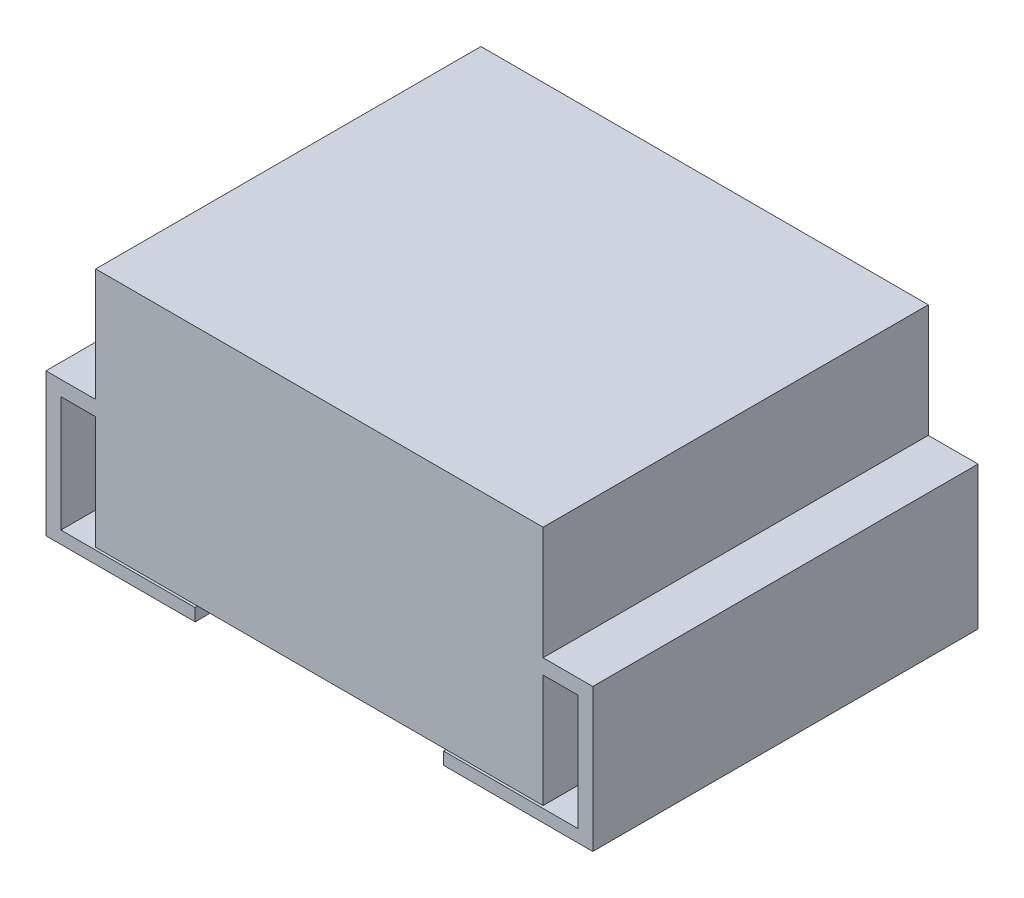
ISO-10303-21;
HEADER;
FILE_DESCRIPTION(('STEP AP214'),'2;1');
FILE_NAME('part.step','',(''),(''),'','','');
FILE_SCHEMA(('AUTOMOTIVE_DESIGN { 1 0 10303 214 1 1 1 1 }'));
ENDSEC;
DATA;
#1=APPLICATION_CONTEXT('core data for automotive mechanical design processes');
#2=APPLICATION_PROTOCOL_DEFINITION('international standard','automotive_design',2000,#1);
#3=PRODUCT_CONTEXT('',#1,'mechanical');
#4=PRODUCT('Part','Part','',(#3));
#5=PRODUCT_RELATED_PRODUCT_CATEGORY('part','',(#4));
#6=PRODUCT_DEFINITION_FORMATION('','',#4);
#7=PRODUCT_DEFINITION_CONTEXT('part definition',#1,'design');
#8=PRODUCT_DEFINITION('design','',#6,#7);
#9=PRODUCT_DEFINITION_SHAPE('','',#8);
#10=(LENGTH_UNIT() NAMED_UNIT(*) SI_UNIT(.MILLI.,.METRE.));
#11=(NAMED_UNIT(*) PLANE_ANGLE_UNIT() SI_UNIT($,.RADIAN.));
#12=(NAMED_UNIT(*) SI_UNIT($,.STERADIAN.) SOLID_ANGLE_UNIT());
#13=UNCERTAINTY_MEASURE_WITH_UNIT(LENGTH_MEASURE(1.E-05),#10,'distance_accuracy_value','');
#14=(GEOMETRIC_REPRESENTATION_CONTEXT(3) GLOBAL_UNCERTAINTY_ASSIGNED_CONTEXT((#13)) GLOBAL_UNIT_ASSIGNED_CONTEXT((#10,
#11,#12)) REPRESENTATION_CONTEXT('',''));
#15=CARTESIAN_POINT('',(0.,0.,0.));
#16=DIRECTION('',(0.,0.,1.));
#17=DIRECTION('',(1.,0.,0.));
#18=AXIS2_PLACEMENT_3D('',#15,#16,#17);
#19=CARTESIAN_POINT('',(2.286,2.4638,-1.96849999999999));
#20=DIRECTION('',(-1.,0.,0.));
#21=DIRECTION('',(0.,0.,1.));
#22=AXIS2_PLACEMENT_3D('',#19,#20,#21);
#23=PLANE('',#22);
#24=DIRECTION('',(0.,0.,-1.));
#25=VECTOR('',#24,1.);
#26=CARTESIAN_POINT('',(2.286,1.1557,1.96850000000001));
#27=LINE('',#26,#25);
#28=CARTESIAN_POINT('',(2.286,1.1557,1.96850000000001));
#29=VERTEX_POINT('',#28);
#30=CARTESIAN_POINT('',(2.286,1.1557,-1.96849999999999));
#31=VERTEX_POINT('',#30);
#32=EDGE_CURVE('E48',#29,#31,#27,.T.);
#33=ORIENTED_EDGE('',*,*,#32,.F.);
#34=DIRECTION('',(0.,-1.,0.));
#35=VECTOR('',#34,1.);
#36=CARTESIAN_POINT('',(2.286,2.4638,1.96850000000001));
#37=LINE('',#36,#35);
#38=CARTESIAN_POINT('',(2.286,0.,1.96850000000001));
#39=VERTEX_POINT('',#38);
#40=EDGE_CURVE('E295',#29,#39,#37,.T.);
#41=ORIENTED_EDGE('',*,*,#40,.T.);
#42=DIRECTION('',(0.,0.,-1.));
#43=VECTOR('',#42,1.);
#44=CARTESIAN_POINT('',(2.286,0.,-1.96849999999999));
#45=LINE('',#44,#43);
#46=CARTESIAN_POINT('',(2.286,0.,-1.96849999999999));
#47=VERTEX_POINT('',#46);
#48=EDGE_CURVE('E284',#39,#47,#45,.T.);
#49=ORIENTED_EDGE('',*,*,#48,.T.);
#50=DIRECTION('',(0.,-1.,0.));
#51=VECTOR('',#50,1.);
#52=CARTESIAN_POINT('',(2.286,2.4638,-1.96849999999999));
#53=LINE('',#52,#51);
#54=EDGE_CURVE('E41',#31,#47,#53,.T.);
#55=ORIENTED_EDGE('',*,*,#54,.F.);
#56=EDGE_LOOP('',(#33,#41,#49,#55));
#57=FACE_BOUND('',#56,.T.);
#58=ADVANCED_FACE('F34',(#57),#23,.F.);
#59=DIRECTION('',(0.,0.,1.));
#60=VECTOR('',#59,1.);
#61=CARTESIAN_POINT('',(2.286,1.3081,1.96850000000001));
#62=LINE('',#61,#60);
#63=CARTESIAN_POINT('',(2.286,1.3081,-1.96849999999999));
#64=VERTEX_POINT('',#63);
#65=CARTESIAN_POINT('',(2.286,1.3081,1.96850000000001));
#66=VERTEX_POINT('',#65);
#67=EDGE_CURVE('E209',#64,#66,#62,.T.);
#68=ORIENTED_EDGE('',*,*,#67,.F.);
#69=CARTESIAN_POINT('',(2.286,2.4638,-1.96849999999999));
#70=VERTEX_POINT('',#69);
#71=EDGE_CURVE('E11',#70,#64,#53,.T.);
#72=ORIENTED_EDGE('',*,*,#71,.F.);
#73=DIRECTION('',(0.,0.,-1.));
#74=VECTOR('',#73,1.);
#75=CARTESIAN_POINT('',(2.286,2.4638,-1.96849999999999));
#76=LINE('',#75,#74);
#77=CARTESIAN_POINT('',(2.286,2.4638,1.96850000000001));
#78=VERTEX_POINT('',#77);
#79=EDGE_CURVE('E285',#78,#70,#76,.T.);
#80=ORIENTED_EDGE('',*,*,#79,.F.);
#81=EDGE_CURVE('E304',#78,#66,#37,.T.);
#82=ORIENTED_EDGE('',*,*,#81,.T.);
#83=EDGE_LOOP('',(#68,#72,#80,#82));
#84=FACE_BOUND('',#83,.T.);
#85=ADVANCED_FACE('F363',(#84),#23,.F.);
#86=CARTESIAN_POINT('',(-2.286,2.4638,-1.96849999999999));
#87=DIRECTION('',(1.,0.,0.));
#88=DIRECTION('',(0.,0.,-1.));
#89=AXIS2_PLACEMENT_3D('',#86,#87,#88);
#90=PLANE('',#89);
#91=DIRECTION('',(0.,0.,1.));
#92=VECTOR('',#91,1.);
#93=CARTESIAN_POINT('',(-2.286,1.1557,-1.96849999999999));
#94=LINE('',#93,#92);
#95=CARTESIAN_POINT('',(-2.286,1.1557,-1.96849999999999));
#96=VERTEX_POINT('',#95);
#97=CARTESIAN_POINT('',(-2.286,1.1557,1.96850000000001));
#98=VERTEX_POINT('',#97);
#99=EDGE_CURVE('E268',#96,#98,#94,.T.);
#100=ORIENTED_EDGE('',*,*,#99,.F.);
#101=DIRECTION('',(0.,-1.,0.));
#102=VECTOR('',#101,1.);
#103=CARTESIAN_POINT('',(-2.286,2.4638,-1.96849999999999));
#104=LINE('',#103,#102);
#105=CARTESIAN_POINT('',(-2.286,0.,-1.96849999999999));
#106=VERTEX_POINT('',#105);
#107=EDGE_CURVE('E309',#96,#106,#104,.T.);
#108=ORIENTED_EDGE('',*,*,#107,.T.);
#109=DIRECTION('',(0.,0.,1.));
#110=VECTOR('',#109,1.);
#111=CARTESIAN_POINT('',(-2.286,0.,-1.96849999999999));
#112=LINE('',#111,#110);
#113=CARTESIAN_POINT('',(-2.286,0.,1.96850000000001));
#114=VERTEX_POINT('',#113);
#115=EDGE_CURVE('E299',#106,#114,#112,.T.);
#116=ORIENTED_EDGE('',*,*,#115,.T.);
#117=DIRECTION('',(0.,-1.,0.));
#118=VECTOR('',#117,1.);
#119=CARTESIAN_POINT('',(-2.286,2.4638,1.96850000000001));
#120=LINE('',#119,#118);
#121=EDGE_CURVE('E306',#98,#114,#120,.T.);
#122=ORIENTED_EDGE('',*,*,#121,.F.);
#123=EDGE_LOOP('',(#100,#108,#116,#122));
#124=FACE_BOUND('',#123,.T.);
#125=ADVANCED_FACE('F316',(#124),#90,.F.);
#126=DIRECTION('',(0.,0.,-1.));
#127=VECTOR('',#126,1.);
#128=CARTESIAN_POINT('',(-2.286,1.3081,-1.96849999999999));
#129=LINE('',#128,#127);
#130=CARTESIAN_POINT('',(-2.286,1.3081,1.96850000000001));
#131=VERTEX_POINT('',#130);
#132=CARTESIAN_POINT('',(-2.286,1.3081,-1.96849999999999));
#133=VERTEX_POINT('',#132);
#134=EDGE_CURVE('E263',#131,#133,#129,.T.);
#135=ORIENTED_EDGE('',*,*,#134,.F.);
#136=CARTESIAN_POINT('',(-2.286,2.4638,1.96850000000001));
#137=VERTEX_POINT('',#136);
#138=EDGE_CURVE('E307',#137,#131,#120,.T.);
#139=ORIENTED_EDGE('',*,*,#138,.F.);
#140=DIRECTION('',(0.,0.,1.));
#141=VECTOR('',#140,1.);
#142=CARTESIAN_POINT('',(-2.286,2.4638,-1.96849999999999));
#143=LINE('',#142,#141);
#144=CARTESIAN_POINT('',(-2.286,2.4638,-1.96849999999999));
#145=VERTEX_POINT('',#144);
#146=EDGE_CURVE('E291',#145,#137,#143,.T.);
#147=ORIENTED_EDGE('',*,*,#146,.F.);
#148=EDGE_CURVE('E310',#145,#133,#104,.T.);
#149=ORIENTED_EDGE('',*,*,#148,.T.);
#150=EDGE_LOOP('',(#135,#139,#147,#149));
#151=FACE_BOUND('',#150,.T.);
#152=ADVANCED_FACE('F355',(#151),#90,.F.);
#153=CARTESIAN_POINT('',(-2.286,2.4638,-1.96849999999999));
#154=DIRECTION('',(0.,0.,1.));
#155=DIRECTION('',(1.,0.,0.));
#156=AXIS2_PLACEMENT_3D('',#153,#154,#155);
#157=PLANE('',#156);
#158=DIRECTION('',(-1.,0.,0.));
#159=VECTOR('',#158,1.);
#160=CARTESIAN_POINT('',(-2.286,0.,-1.96849999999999));
#161=LINE('',#160,#159);
#162=EDGE_CURVE('E297',#47,#106,#161,.T.);
#163=ORIENTED_EDGE('',*,*,#162,.T.);
#164=ORIENTED_EDGE('',*,*,#107,.F.);
#165=DIRECTION('',(1.,0.,0.));
#166=VECTOR('',#165,1.);
#167=CARTESIAN_POINT('',(-2.6416,1.1557,-1.96849999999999));
#168=LINE('',#167,#166);
#169=CARTESIAN_POINT('',(-2.6416,1.1557,-1.96849999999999));
#170=VERTEX_POINT('',#169);
#171=EDGE_CURVE('E275',#170,#96,#168,.T.);
#172=ORIENTED_EDGE('',*,*,#171,.F.);
#173=DIRECTION('',(0.,-1.,0.));
#174=VECTOR('',#173,1.);
#175=CARTESIAN_POINT('',(-2.6416,-0.1524,-1.96849999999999));
#176=LINE('',#175,#174);
#177=CARTESIAN_POINT('',(-2.6416,-0.0254,-1.96849999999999));
#178=VERTEX_POINT('',#177);
#179=EDGE_CURVE('E239',#170,#178,#176,.T.);
#180=ORIENTED_EDGE('',*,*,#179,.T.);
#181=DIRECTION('',(-1.,0.,0.));
#182=VECTOR('',#181,1.);
#183=CARTESIAN_POINT('',(-1.27,-0.0254,-1.96849999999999));
#184=LINE('',#183,#182);
#185=CARTESIAN_POINT('',(-1.27,-0.0254,-1.96849999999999));
#186=VERTEX_POINT('',#185);
#187=EDGE_CURVE('E229',#186,#178,#184,.T.);
#188=ORIENTED_EDGE('',*,*,#187,.F.);
#189=DIRECTION('',(0.,1.,0.));
#190=VECTOR('',#189,1.);
#191=CARTESIAN_POINT('',(-1.27,-0.1524,-1.96849999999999));
#192=LINE('',#191,#190);
#193=CARTESIAN_POINT('',(-1.27,-0.1524,-1.96849999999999));
#194=VERTEX_POINT('',#193);
#195=EDGE_CURVE('E226',#194,#186,#192,.T.);
#196=ORIENTED_EDGE('',*,*,#195,.F.);
#197=DIRECTION('',(1.,0.,0.));
#198=VECTOR('',#197,1.);
#199=CARTESIAN_POINT('',(-2.794,-0.1524,-1.96849999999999));
#200=LINE('',#199,#198);
#201=CARTESIAN_POINT('',(-2.794,-0.1524,-1.96849999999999));
#202=VERTEX_POINT('',#201);
#203=EDGE_CURVE('E261',#202,#194,#200,.T.);
#204=ORIENTED_EDGE('',*,*,#203,.F.);
#205=DIRECTION('',(0.,-1.,0.));
#206=VECTOR('',#205,1.);
#207=CARTESIAN_POINT('',(-2.794,-0.1524,-1.96849999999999));
#208=LINE('',#207,#206);
#209=CARTESIAN_POINT('',(-2.794,1.3081,-1.96849999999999));
#210=VERTEX_POINT('',#209);
#211=EDGE_CURVE('E244',#210,#202,#208,.T.);
#212=ORIENTED_EDGE('',*,*,#211,.F.);
#213=DIRECTION('',(1.,0.,0.));
#214=VECTOR('',#213,1.);
#215=CARTESIAN_POINT('',(-2.6416,1.3081,-1.96849999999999));
#216=LINE('',#215,#214);
#217=EDGE_CURVE('E278',#210,#133,#216,.T.);
#218=ORIENTED_EDGE('',*,*,#217,.T.);
#219=ORIENTED_EDGE('',*,*,#148,.F.);
#220=DIRECTION('',(-1.,0.,0.));
#221=VECTOR('',#220,1.);
#222=CARTESIAN_POINT('',(-2.286,2.4638,-1.96849999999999));
#223=LINE('',#222,#221);
#224=EDGE_CURVE('E288',#70,#145,#223,.T.);
#225=ORIENTED_EDGE('',*,*,#224,.F.);
#226=ORIENTED_EDGE('',*,*,#71,.T.);
#227=DIRECTION('',(-1.,0.,0.));
#228=VECTOR('',#227,1.);
#229=CARTESIAN_POINT('',(2.6416,1.3081,-1.96849999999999));
#230=LINE('',#229,#228);
#231=CARTESIAN_POINT('',(2.794,1.3081,-1.96849999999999));
#232=VERTEX_POINT('',#231);
#233=EDGE_CURVE('E222',#232,#64,#230,.T.);
#234=ORIENTED_EDGE('',*,*,#233,.F.);
#235=DIRECTION('',(0.,1.,0.));
#236=VECTOR('',#235,1.);
#237=CARTESIAN_POINT('',(2.794,1.3081,-1.96849999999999));
#238=LINE('',#237,#236);
#239=CARTESIAN_POINT('',(2.794,-0.1524,-1.9685));
#240=VERTEX_POINT('',#239);
#241=EDGE_CURVE('E207',#240,#232,#238,.T.);
#242=ORIENTED_EDGE('',*,*,#241,.F.);
#243=DIRECTION('',(-1.,0.,0.));
#244=VECTOR('',#243,1.);
#245=CARTESIAN_POINT('',(2.794,-0.1524,-1.9685));
#246=LINE('',#245,#244);
#247=CARTESIAN_POINT('',(1.27,-0.1524,-1.96849999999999));
#248=VERTEX_POINT('',#247);
#249=EDGE_CURVE('E204',#240,#248,#246,.T.);
#250=ORIENTED_EDGE('',*,*,#249,.T.);
#251=DIRECTION('',(0.,-1.,0.));
#252=VECTOR('',#251,1.);
#253=CARTESIAN_POINT('',(1.27,-0.1524,-1.96849999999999));
#254=LINE('',#253,#252);
#255=CARTESIAN_POINT('',(1.27,-0.0254000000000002,-1.96849999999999));
#256=VERTEX_POINT('',#255);
#257=EDGE_CURVE('E178',#256,#248,#254,.T.);
#258=ORIENTED_EDGE('',*,*,#257,.F.);
#259=DIRECTION('',(-1.,0.,0.));
#260=VECTOR('',#259,1.);
#261=CARTESIAN_POINT('',(1.27,-0.0254000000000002,-1.96849999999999));
#262=LINE('',#261,#260);
#263=CARTESIAN_POINT('',(2.6416,-0.0254000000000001,-1.96849999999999));
#264=VERTEX_POINT('',#263);
#265=EDGE_CURVE('E170',#264,#256,#262,.T.);
#266=ORIENTED_EDGE('',*,*,#265,.F.);
#267=DIRECTION('',(0.,1.,0.));
#268=VECTOR('',#267,1.);
#269=CARTESIAN_POINT('',(2.6416,1.3081,-1.96849999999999));
#270=LINE('',#269,#268);
#271=CARTESIAN_POINT('',(2.6416,1.1557,-1.96849999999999));
#272=VERTEX_POINT('',#271);
#273=EDGE_CURVE('E185',#264,#272,#270,.T.);
#274=ORIENTED_EDGE('',*,*,#273,.T.);
#275=DIRECTION('',(-1.,0.,0.));
#276=VECTOR('',#275,1.);
#277=CARTESIAN_POINT('',(2.6416,1.1557,-1.96849999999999));
#278=LINE('',#277,#276);
#279=EDGE_CURVE('E211',#272,#31,#278,.T.);
#280=ORIENTED_EDGE('',*,*,#279,.T.);
#281=ORIENTED_EDGE('',*,*,#54,.T.);
#282=EDGE_LOOP('',(#163,#164,#172,#180,#188,#196,#204,#212,#218,#219,#225,#226,#234,#242,#250,
#258,#266,#274,#280,#281));
#283=FACE_BOUND('',#282,.T.);
#284=ADVANCED_FACE('F183',(#283),#157,.F.);
#285=CARTESIAN_POINT('',(-2.286,2.4638,1.96850000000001));
#286=DIRECTION('',(0.,0.,-1.));
#287=DIRECTION('',(-1.,0.,0.));
#288=AXIS2_PLACEMENT_3D('',#285,#286,#287);
#289=PLANE('',#288);
#290=DIRECTION('',(1.,0.,0.));
#291=VECTOR('',#290,1.);
#292=CARTESIAN_POINT('',(-2.286,0.,1.96850000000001));
#293=LINE('',#292,#291);
#294=EDGE_CURVE('E289',#114,#39,#293,.T.);
#295=ORIENTED_EDGE('',*,*,#294,.T.);
#296=ORIENTED_EDGE('',*,*,#40,.F.);
#297=DIRECTION('',(-1.,0.,0.));
#298=VECTOR('',#297,1.);
#299=CARTESIAN_POINT('',(2.6416,1.1557,1.96850000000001));
#300=LINE('',#299,#298);
#301=CARTESIAN_POINT('',(2.6416,1.1557,1.96850000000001));
#302=VERTEX_POINT('',#301);
#303=EDGE_CURVE('E216',#302,#29,#300,.T.);
#304=ORIENTED_EDGE('',*,*,#303,.F.);
#305=DIRECTION('',(0.,-1.,0.));
#306=VECTOR('',#305,1.);
#307=CARTESIAN_POINT('',(2.6416,-0.1524,1.9685));
#308=LINE('',#307,#306);
#309=CARTESIAN_POINT('',(2.6416,-0.0254000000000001,1.96850000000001));
#310=VERTEX_POINT('',#309);
#311=EDGE_CURVE('E195',#302,#310,#308,.T.);
#312=ORIENTED_EDGE('',*,*,#311,.T.);
#313=DIRECTION('',(-1.,0.,0.));
#314=VECTOR('',#313,1.);
#315=CARTESIAN_POINT('',(1.27,-0.0254000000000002,1.96850000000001));
#316=LINE('',#315,#314);
#317=CARTESIAN_POINT('',(1.27,-0.0254000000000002,1.96850000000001));
#318=VERTEX_POINT('',#317);
#319=EDGE_CURVE('E172',#310,#318,#316,.T.);
#320=ORIENTED_EDGE('',*,*,#319,.T.);
#321=DIRECTION('',(0.,-1.,0.));
#322=VECTOR('',#321,1.);
#323=CARTESIAN_POINT('',(1.27,-0.1524,1.96850000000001));
#324=LINE('',#323,#322);
#325=CARTESIAN_POINT('',(1.27,-0.1524,1.96850000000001));
#326=VERTEX_POINT('',#325);
#327=EDGE_CURVE('E188',#318,#326,#324,.T.);
#328=ORIENTED_EDGE('',*,*,#327,.T.);
#329=DIRECTION('',(-1.,0.,0.));
#330=VECTOR('',#329,1.);
#331=CARTESIAN_POINT('',(2.794,-0.1524,1.9685));
#332=LINE('',#331,#330);
#333=CARTESIAN_POINT('',(2.794,-0.1524,1.9685));
#334=VERTEX_POINT('',#333);
#335=EDGE_CURVE('E206',#334,#326,#332,.T.);
#336=ORIENTED_EDGE('',*,*,#335,.F.);
#337=DIRECTION('',(0.,-1.,0.));
#338=VECTOR('',#337,1.);
#339=CARTESIAN_POINT('',(2.794,-0.1524,1.9685));
#340=LINE('',#339,#338);
#341=CARTESIAN_POINT('',(2.794,1.3081,1.96850000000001));
#342=VERTEX_POINT('',#341);
#343=EDGE_CURVE('E198',#342,#334,#340,.T.);
#344=ORIENTED_EDGE('',*,*,#343,.F.);
#345=DIRECTION('',(-1.,0.,0.));
#346=VECTOR('',#345,1.);
#347=CARTESIAN_POINT('',(2.6416,1.3081,1.96850000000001));
#348=LINE('',#347,#346);
#349=EDGE_CURVE('E219',#342,#66,#348,.T.);
#350=ORIENTED_EDGE('',*,*,#349,.T.);
#351=ORIENTED_EDGE('',*,*,#81,.F.);
#352=DIRECTION('',(1.,0.,0.));
#353=VECTOR('',#352,1.);
#354=CARTESIAN_POINT('',(-2.286,2.4638,1.96850000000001));
#355=LINE('',#354,#353);
#356=EDGE_CURVE('E293',#137,#78,#355,.T.);
#357=ORIENTED_EDGE('',*,*,#356,.F.);
#358=ORIENTED_EDGE('',*,*,#138,.T.);
#359=DIRECTION('',(1.,0.,0.));
#360=VECTOR('',#359,1.);
#361=CARTESIAN_POINT('',(-2.6416,1.3081,1.96850000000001));
#362=LINE('',#361,#360);
#363=CARTESIAN_POINT('',(-2.794,1.3081,1.96850000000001));
#364=VERTEX_POINT('',#363);
#365=EDGE_CURVE('E281',#364,#131,#362,.T.);
#366=ORIENTED_EDGE('',*,*,#365,.F.);
#367=DIRECTION('',(0.,1.,0.));
#368=VECTOR('',#367,1.);
#369=CARTESIAN_POINT('',(-2.794,1.3081,1.96850000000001));
#370=LINE('',#369,#368);
#371=CARTESIAN_POINT('',(-2.794,-0.1524,1.96850000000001));
#372=VERTEX_POINT('',#371);
#373=EDGE_CURVE('E250',#372,#364,#370,.T.);
#374=ORIENTED_EDGE('',*,*,#373,.F.);
#375=DIRECTION('',(1.,0.,0.));
#376=VECTOR('',#375,1.);
#377=CARTESIAN_POINT('',(-2.794,-0.1524,1.96850000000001));
#378=LINE('',#377,#376);
#379=CARTESIAN_POINT('',(-1.27,-0.1524,1.96850000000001));
#380=VERTEX_POINT('',#379);
#381=EDGE_CURVE('E256',#372,#380,#378,.T.);
#382=ORIENTED_EDGE('',*,*,#381,.T.);
#383=DIRECTION('',(0.,1.,0.));
#384=VECTOR('',#383,1.);
#385=CARTESIAN_POINT('',(-1.27,-0.1524,1.96850000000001));
#386=LINE('',#385,#384);
#387=CARTESIAN_POINT('',(-1.27,-0.0254,1.96850000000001));
#388=VERTEX_POINT('',#387);
#389=EDGE_CURVE('E225',#380,#388,#386,.T.);
#390=ORIENTED_EDGE('',*,*,#389,.T.);
#391=DIRECTION('',(-1.,0.,0.));
#392=VECTOR('',#391,1.);
#393=CARTESIAN_POINT('',(-1.27,-0.0254,1.96850000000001));
#394=LINE('',#393,#392);
#395=CARTESIAN_POINT('',(-2.6416,-0.0254000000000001,1.96850000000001));
#396=VERTEX_POINT('',#395);
#397=EDGE_CURVE('E230',#388,#396,#394,.T.);
#398=ORIENTED_EDGE('',*,*,#397,.T.);
#399=DIRECTION('',(0.,1.,0.));
#400=VECTOR('',#399,1.);
#401=CARTESIAN_POINT('',(-2.6416,1.3081,1.96850000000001));
#402=LINE('',#401,#400);
#403=CARTESIAN_POINT('',(-2.6416,1.1557,1.96850000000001));
#404=VERTEX_POINT('',#403);
#405=EDGE_CURVE('E248',#396,#404,#402,.T.);
#406=ORIENTED_EDGE('',*,*,#405,.T.);
#407=DIRECTION('',(1.,0.,0.));
#408=VECTOR('',#407,1.);
#409=CARTESIAN_POINT('',(-2.6416,1.1557,1.96850000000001));
#410=LINE('',#409,#408);
#411=EDGE_CURVE('E267',#404,#98,#410,.T.);
#412=ORIENTED_EDGE('',*,*,#411,.T.);
#413=ORIENTED_EDGE('',*,*,#121,.T.);
#414=EDGE_LOOP('',(#295,#296,#304,#312,#320,#328,#336,#344,#350,#351,#357,#358,#366,#374,#382,
#390,#398,#406,#412,#413));
#415=FACE_BOUND('',#414,.T.);
#416=ADVANCED_FACE('F324',(#415),#289,.F.);
#417=CARTESIAN_POINT('',(0.,2.4638,0.));
#418=DIRECTION('',(0.,1.,0.));
#419=DIRECTION('',(0.,0.,1.));
#420=AXIS2_PLACEMENT_3D('',#417,#418,#419);
#421=PLANE('',#420);
#422=ORIENTED_EDGE('',*,*,#79,.T.);
#423=ORIENTED_EDGE('',*,*,#224,.T.);
#424=ORIENTED_EDGE('',*,*,#146,.T.);
#425=ORIENTED_EDGE('',*,*,#356,.T.);
#426=EDGE_LOOP('',(#422,#423,#424,#425));
#427=FACE_BOUND('',#426,.T.);
#428=ADVANCED_FACE('F358',(#427),#421,.T.);
#429=CARTESIAN_POINT('',(0.,0.,0.));
#430=DIRECTION('',(0.,1.,0.));
#431=DIRECTION('',(0.,0.,1.));
#432=AXIS2_PLACEMENT_3D('',#429,#430,#431);
#433=PLANE('',#432);
#434=ORIENTED_EDGE('',*,*,#48,.F.);
#435=ORIENTED_EDGE('',*,*,#294,.F.);
#436=ORIENTED_EDGE('',*,*,#115,.F.);
#437=ORIENTED_EDGE('',*,*,#162,.F.);
#438=EDGE_LOOP('',(#434,#435,#436,#437));
#439=FACE_BOUND('',#438,.T.);
#440=ADVANCED_FACE('F322',(#439),#433,.F.);
#441=CARTESIAN_POINT('',(-2.6416,1.3081,-1.96849999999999));
#442=DIRECTION('',(0.,-1.,0.));
#443=DIRECTION('',(0.,0.,-1.));
#444=AXIS2_PLACEMENT_3D('',#441,#442,#443);
#445=PLANE('',#444);
#446=ORIENTED_EDGE('',*,*,#134,.T.);
#447=ORIENTED_EDGE('',*,*,#217,.F.);
#448=DIRECTION('',(0.,0.,-1.));
#449=VECTOR('',#448,1.);
#450=CARTESIAN_POINT('',(-2.794,1.3081,-1.96849999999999));
#451=LINE('',#450,#449);
#452=EDGE_CURVE('E253',#364,#210,#451,.T.);
#453=ORIENTED_EDGE('',*,*,#452,.F.);
#454=ORIENTED_EDGE('',*,*,#365,.T.);
#455=EDGE_LOOP('',(#446,#447,#453,#454));
#456=FACE_BOUND('',#455,.T.);
#457=ADVANCED_FACE('F353',(#456),#445,.F.);
#458=CARTESIAN_POINT('',(-2.6416,1.1557,-1.96849999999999));
#459=DIRECTION('',(0.,1.,0.));
#460=DIRECTION('',(0.,0.,1.));
#461=AXIS2_PLACEMENT_3D('',#458,#459,#460);
#462=PLANE('',#461);
#463=ORIENTED_EDGE('',*,*,#99,.T.);
#464=ORIENTED_EDGE('',*,*,#411,.F.);
#465=DIRECTION('',(0.,0.,1.));
#466=VECTOR('',#465,1.);
#467=CARTESIAN_POINT('',(-2.6416,1.1557,-1.96849999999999));
#468=LINE('',#467,#466);
#469=EDGE_CURVE('E264',#170,#404,#468,.T.);
#470=ORIENTED_EDGE('',*,*,#469,.F.);
#471=ORIENTED_EDGE('',*,*,#171,.T.);
#472=EDGE_LOOP('',(#463,#464,#470,#471));
#473=FACE_BOUND('',#472,.T.);
#474=ADVANCED_FACE('F327',(#473),#462,.F.);
#475=CARTESIAN_POINT('',(-2.794,-0.1524,1.96850000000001));
#476=DIRECTION('',(0.,1.,0.));
#477=DIRECTION('',(0.,0.,1.));
#478=AXIS2_PLACEMENT_3D('',#475,#476,#477);
#479=PLANE('',#478);
#480=ORIENTED_EDGE('',*,*,#203,.T.);
#481=DIRECTION('',(0.,0.,1.));
#482=VECTOR('',#481,1.);
#483=CARTESIAN_POINT('',(-1.27,-0.1524,-1.96849999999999));
#484=LINE('',#483,#482);
#485=EDGE_CURVE('E232',#194,#380,#484,.T.);
#486=ORIENTED_EDGE('',*,*,#485,.T.);
#487=ORIENTED_EDGE('',*,*,#381,.F.);
#488=DIRECTION('',(0.,0.,1.));
#489=VECTOR('',#488,1.);
#490=CARTESIAN_POINT('',(-2.794,-0.1524,1.96850000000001));
#491=LINE('',#490,#489);
#492=EDGE_CURVE('E247',#202,#372,#491,.T.);
#493=ORIENTED_EDGE('',*,*,#492,.F.);
#494=EDGE_LOOP('',(#480,#486,#487,#493));
#495=FACE_BOUND('',#494,.T.);
#496=ADVANCED_FACE('F346',(#495),#479,.F.);
#497=CARTESIAN_POINT('',(-2.794,0.,0.));
#498=DIRECTION('',(1.,0.,0.));
#499=DIRECTION('',(0.,0.,-1.));
#500=AXIS2_PLACEMENT_3D('',#497,#498,#499);
#501=PLANE('',#500);
#502=ORIENTED_EDGE('',*,*,#211,.T.);
#503=ORIENTED_EDGE('',*,*,#492,.T.);
#504=ORIENTED_EDGE('',*,*,#373,.T.);
#505=ORIENTED_EDGE('',*,*,#452,.T.);
#506=EDGE_LOOP('',(#502,#503,#504,#505));
#507=FACE_BOUND('',#506,.T.);
#508=ADVANCED_FACE('F350',(#507),#501,.F.);
#509=CARTESIAN_POINT('',(-2.6416,0.,0.));
#510=DIRECTION('',(1.,0.,0.));
#511=DIRECTION('',(0.,0.,-1.));
#512=AXIS2_PLACEMENT_3D('',#509,#510,#511);
#513=PLANE('',#512);
#514=DIRECTION('',(0.,0.,1.));
#515=VECTOR('',#514,1.);
#516=CARTESIAN_POINT('',(-2.6416,-0.0254,-1.96849999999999));
#517=LINE('',#516,#515);
#518=EDGE_CURVE('E236',#178,#396,#517,.T.);
#519=ORIENTED_EDGE('',*,*,#518,.F.);
#520=ORIENTED_EDGE('',*,*,#179,.F.);
#521=ORIENTED_EDGE('',*,*,#469,.T.);
#522=ORIENTED_EDGE('',*,*,#405,.F.);
#523=EDGE_LOOP('',(#519,#520,#521,#522));
#524=FACE_BOUND('',#523,.T.);
#525=ADVANCED_FACE('F334',(#524),#513,.T.);
#526=CARTESIAN_POINT('',(-1.27,-0.0254,-1.96849999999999));
#527=DIRECTION('',(0.,1.,0.));
#528=DIRECTION('',(0.,0.,1.));
#529=AXIS2_PLACEMENT_3D('',#526,#527,#528);
#530=PLANE('',#529);
#531=ORIENTED_EDGE('',*,*,#397,.F.);
#532=DIRECTION('',(0.,0.,1.));
#533=VECTOR('',#532,1.);
#534=CARTESIAN_POINT('',(-1.27,-0.0254,-1.96849999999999));
#535=LINE('',#534,#533);
#536=EDGE_CURVE('E240',#186,#388,#535,.T.);
#537=ORIENTED_EDGE('',*,*,#536,.F.);
#538=ORIENTED_EDGE('',*,*,#187,.T.);
#539=ORIENTED_EDGE('',*,*,#518,.T.);
#540=EDGE_LOOP('',(#531,#537,#538,#539));
#541=FACE_BOUND('',#540,.T.);
#542=ADVANCED_FACE('F338',(#541),#530,.T.);
#543=CARTESIAN_POINT('',(-1.27,-0.1524,-1.96849999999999));
#544=DIRECTION('',(1.,0.,0.));
#545=DIRECTION('',(0.,0.,-1.));
#546=AXIS2_PLACEMENT_3D('',#543,#544,#545);
#547=PLANE('',#546);
#548=ORIENTED_EDGE('',*,*,#389,.F.);
#549=ORIENTED_EDGE('',*,*,#485,.F.);
#550=ORIENTED_EDGE('',*,*,#195,.T.);
#551=ORIENTED_EDGE('',*,*,#536,.T.);
#552=EDGE_LOOP('',(#548,#549,#550,#551));
#553=FACE_BOUND('',#552,.T.);
#554=ADVANCED_FACE('F342',(#553),#547,.T.);
#555=CARTESIAN_POINT('',(2.6416,1.3081,1.96850000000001));
#556=DIRECTION('',(0.,-1.,0.));
#557=DIRECTION('',(0.,0.,-1.));
#558=AXIS2_PLACEMENT_3D('',#555,#556,#557);
#559=PLANE('',#558);
#560=ORIENTED_EDGE('',*,*,#67,.T.);
#561=ORIENTED_EDGE('',*,*,#349,.F.);
#562=DIRECTION('',(0.,0.,1.));
#563=VECTOR('',#562,1.);
#564=CARTESIAN_POINT('',(2.794,1.3081,1.96850000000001));
#565=LINE('',#564,#563);
#566=EDGE_CURVE('E194',#232,#342,#565,.T.);
#567=ORIENTED_EDGE('',*,*,#566,.F.);
#568=ORIENTED_EDGE('',*,*,#233,.T.);
#569=EDGE_LOOP('',(#560,#561,#567,#568));
#570=FACE_BOUND('',#569,.T.);
#571=ADVANCED_FACE('F368',(#570),#559,.F.);
#572=CARTESIAN_POINT('',(2.6416,1.1557,1.96850000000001));
#573=DIRECTION('',(0.,1.,0.));
#574=DIRECTION('',(0.,0.,1.));
#575=AXIS2_PLACEMENT_3D('',#572,#573,#574);
#576=PLANE('',#575);
#577=ORIENTED_EDGE('',*,*,#32,.T.);
#578=ORIENTED_EDGE('',*,*,#279,.F.);
#579=DIRECTION('',(0.,0.,-1.));
#580=VECTOR('',#579,1.);
#581=CARTESIAN_POINT('',(2.6416,1.1557,1.96850000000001));
#582=LINE('',#581,#580);
#583=EDGE_CURVE('E193',#302,#272,#582,.T.);
#584=ORIENTED_EDGE('',*,*,#583,.F.);
#585=ORIENTED_EDGE('',*,*,#303,.T.);
#586=EDGE_LOOP('',(#577,#578,#584,#585));
#587=FACE_BOUND('',#586,.T.);
#588=ADVANCED_FACE('F390',(#587),#576,.F.);
#589=CARTESIAN_POINT('',(2.794,-0.1524,-1.9685));
#590=DIRECTION('',(0.,1.,0.));
#591=DIRECTION('',(0.,0.,1.));
#592=AXIS2_PLACEMENT_3D('',#589,#590,#591);
#593=PLANE('',#592);
#594=ORIENTED_EDGE('',*,*,#335,.T.);
#595=DIRECTION('',(0.,0.,1.));
#596=VECTOR('',#595,1.);
#597=CARTESIAN_POINT('',(1.27,-0.1524,-1.96849999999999));
#598=LINE('',#597,#596);
#599=EDGE_CURVE('E200',#248,#326,#598,.T.);
#600=ORIENTED_EDGE('',*,*,#599,.F.);
#601=ORIENTED_EDGE('',*,*,#249,.F.);
#602=DIRECTION('',(0.,0.,-1.));
#603=VECTOR('',#602,1.);
#604=CARTESIAN_POINT('',(2.794,-0.1524,-1.9685));
#605=LINE('',#604,#603);
#606=EDGE_CURVE('E374',#334,#240,#605,.T.);
#607=ORIENTED_EDGE('',*,*,#606,.F.);
#608=EDGE_LOOP('',(#594,#600,#601,#607));
#609=FACE_BOUND('',#608,.T.);
#610=ADVANCED_FACE('F392',(#609),#593,.F.);
#611=CARTESIAN_POINT('',(2.794,0.,0.));
#612=DIRECTION('',(-1.,0.,0.));
#613=DIRECTION('',(0.,0.,1.));
#614=AXIS2_PLACEMENT_3D('',#611,#612,#613);
#615=PLANE('',#614);
#616=ORIENTED_EDGE('',*,*,#566,.T.);
#617=ORIENTED_EDGE('',*,*,#343,.T.);
#618=ORIENTED_EDGE('',*,*,#606,.T.);
#619=ORIENTED_EDGE('',*,*,#241,.T.);
#620=EDGE_LOOP('',(#616,#617,#618,#619));
#621=FACE_BOUND('',#620,.T.);
#622=ADVANCED_FACE('F371',(#621),#615,.F.);
#623=CARTESIAN_POINT('',(2.6416,0.,0.));
#624=DIRECTION('',(-1.,0.,0.));
#625=DIRECTION('',(0.,0.,1.));
#626=AXIS2_PLACEMENT_3D('',#623,#624,#625);
#627=PLANE('',#626);
#628=DIRECTION('',(0.,0.,1.));
#629=VECTOR('',#628,1.);
#630=CARTESIAN_POINT('',(2.6416,-0.0254000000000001,-1.96849999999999));
#631=LINE('',#630,#629);
#632=EDGE_CURVE('E167',#264,#310,#631,.T.);
#633=ORIENTED_EDGE('',*,*,#632,.T.);
#634=ORIENTED_EDGE('',*,*,#311,.F.);
#635=ORIENTED_EDGE('',*,*,#583,.T.);
#636=ORIENTED_EDGE('',*,*,#273,.F.);
#637=EDGE_LOOP('',(#633,#634,#635,#636));
#638=FACE_BOUND('',#637,.T.);
#639=ADVANCED_FACE('F191',(#638),#627,.T.);
#640=CARTESIAN_POINT('',(1.27,-0.1524,-1.96849999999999));
#641=DIRECTION('',(-1.,0.,0.));
#642=DIRECTION('',(0.,0.,1.));
#643=AXIS2_PLACEMENT_3D('',#640,#641,#642);
#644=PLANE('',#643);
#645=ORIENTED_EDGE('',*,*,#327,.F.);
#646=DIRECTION('',(0.,0.,1.));
#647=VECTOR('',#646,1.);
#648=CARTESIAN_POINT('',(1.27,-0.0254000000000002,-1.96849999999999));
#649=LINE('',#648,#647);
#650=EDGE_CURVE('E177',#256,#318,#649,.T.);
#651=ORIENTED_EDGE('',*,*,#650,.F.);
#652=ORIENTED_EDGE('',*,*,#257,.T.);
#653=ORIENTED_EDGE('',*,*,#599,.T.);
#654=EDGE_LOOP('',(#645,#651,#652,#653));
#655=FACE_BOUND('',#654,.T.);
#656=ADVANCED_FACE('F387',(#655),#644,.T.);
#657=CARTESIAN_POINT('',(1.27,-0.0254000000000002,-1.96849999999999));
#658=DIRECTION('',(0.,1.,0.));
#659=DIRECTION('',(-1.,0.,0.));
#660=AXIS2_PLACEMENT_3D('',#657,#658,#659);
#661=PLANE('',#660);
#662=ORIENTED_EDGE('',*,*,#319,.F.);
#663=ORIENTED_EDGE('',*,*,#632,.F.);
#664=ORIENTED_EDGE('',*,*,#265,.T.);
#665=ORIENTED_EDGE('',*,*,#650,.T.);
#666=EDGE_LOOP('',(#662,#663,#664,#665));
#667=FACE_BOUND('',#666,.T.);
#668=ADVANCED_FACE('F169',(#667),#661,.T.);
#669=CLOSED_SHELL('',(#58,#85,#125,#152,#284,#416,#428,#440,#457,#474,#496,#508,#525,#542,#554,
#571,#588,#610,#622,#639,#656,#668));
#670=MANIFOLD_SOLID_BREP('B2',#669);
#671=ADVANCED_BREP_SHAPE_REPRESENTATION('',(#18,#670),#14);
#672=SHAPE_DEFINITION_REPRESENTATION(#9,#671);
ENDSEC;
END-ISO-10303-21;
